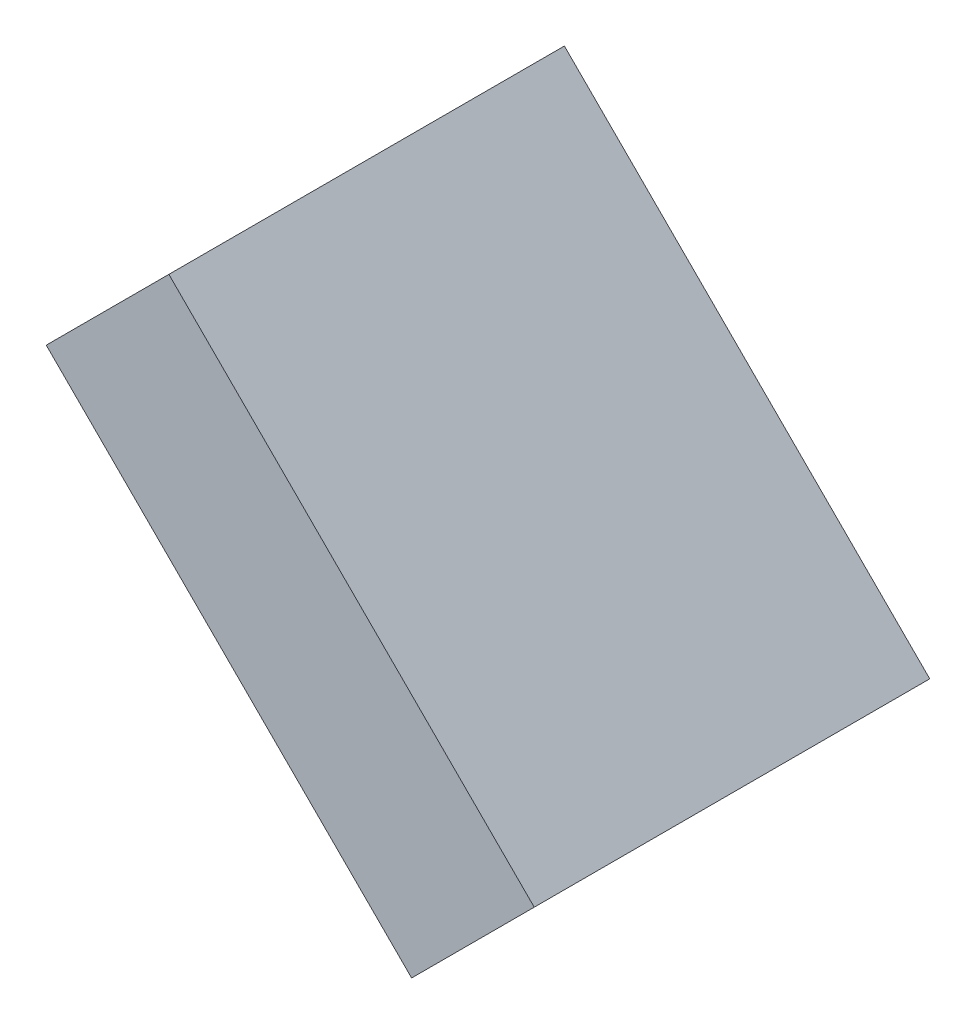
ISO-10303-21;
HEADER;
FILE_DESCRIPTION(('STEP AP214'),'2;1');
FILE_NAME('part.step','',(''),(''),'','','');
FILE_SCHEMA(('AUTOMOTIVE_DESIGN { 1 0 10303 214 1 1 1 1 }'));
ENDSEC;
DATA;
#1=APPLICATION_CONTEXT('core data for automotive mechanical design processes');
#2=APPLICATION_PROTOCOL_DEFINITION('international standard','automotive_design',2000,#1);
#3=PRODUCT_CONTEXT('',#1,'mechanical');
#4=PRODUCT('Part','Part','',(#3));
#5=PRODUCT_RELATED_PRODUCT_CATEGORY('part','',(#4));
#6=PRODUCT_DEFINITION_FORMATION('','',#4);
#7=PRODUCT_DEFINITION_CONTEXT('part definition',#1,'design');
#8=PRODUCT_DEFINITION('design','',#6,#7);
#9=PRODUCT_DEFINITION_SHAPE('','',#8);
#10=(LENGTH_UNIT() NAMED_UNIT(*) SI_UNIT(.MILLI.,.METRE.));
#11=(NAMED_UNIT(*) PLANE_ANGLE_UNIT() SI_UNIT($,.RADIAN.));
#12=(NAMED_UNIT(*) SI_UNIT($,.STERADIAN.) SOLID_ANGLE_UNIT());
#13=UNCERTAINTY_MEASURE_WITH_UNIT(LENGTH_MEASURE(1.E-05),#10,'distance_accuracy_value','');
#14=(GEOMETRIC_REPRESENTATION_CONTEXT(3) GLOBAL_UNCERTAINTY_ASSIGNED_CONTEXT((#13)) GLOBAL_UNIT_ASSIGNED_CONTEXT((#10,
#11,#12)) REPRESENTATION_CONTEXT('',''));
#15=CARTESIAN_POINT('',(0.,0.,0.));
#16=DIRECTION('',(0.,0.,1.));
#17=DIRECTION('',(1.,0.,0.));
#18=AXIS2_PLACEMENT_3D('',#15,#16,#17);
#19=CARTESIAN_POINT('',(1.270000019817E-06,0.,0.22999954));
#20=DIRECTION('',(0.,0.,-1.));
#21=DIRECTION('',(0.,-1.,0.));
#22=AXIS2_PLACEMENT_3D('',#19,#20,#21);
#23=PLANE('',#22);
#24=DIRECTION('',(-0.707111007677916,0.707102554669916,0.));
#25=VECTOR('',#24,1.);
#26=CARTESIAN_POINT('',(0.07058406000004,-0.14189202,0.22999954));
#27=LINE('',#26,#25);
#28=CARTESIAN_POINT('',(0.07058406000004,-0.14189202,0.22999954));
#29=VERTEX_POINT('',#28);
#30=CARTESIAN_POINT('',(-0.14189202,0.07058151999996,0.22999954));
#31=VERTEX_POINT('',#30);
#32=EDGE_CURVE('E27',#29,#31,#27,.T.);
#33=ORIENTED_EDGE('',*,*,#32,.F.);
#34=DIRECTION('',(-0.707106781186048,-0.707106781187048,0.));
#35=VECTOR('',#34,1.);
#36=CARTESIAN_POINT('',(0.14189456,-0.07058151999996,0.22999954));
#37=LINE('',#36,#35);
#38=CARTESIAN_POINT('',(0.14189456,-0.07058151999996,0.22999954));
#39=VERTEX_POINT('',#38);
#40=EDGE_CURVE('E65',#39,#29,#37,.T.);
#41=ORIENTED_EDGE('',*,*,#40,.F.);
#42=DIRECTION('',(0.707111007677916,-0.707102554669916,0.));
#43=VECTOR('',#42,1.);
#44=CARTESIAN_POINT('',(-0.07058151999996,0.14189202,0.22999954));
#45=LINE('',#44,#43);
#46=CARTESIAN_POINT('',(-0.07058151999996,0.14189202,0.22999954));
#47=VERTEX_POINT('',#46);
#48=EDGE_CURVE('E74',#47,#39,#45,.T.);
#49=ORIENTED_EDGE('',*,*,#48,.F.);
#50=DIRECTION('',(0.707106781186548,0.707106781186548,0.));
#51=VECTOR('',#50,1.);
#52=CARTESIAN_POINT('',(-0.14189202,0.07058151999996,0.22999954));
#53=LINE('',#52,#51);
#54=EDGE_CURVE('E85',#31,#47,#53,.T.);
#55=ORIENTED_EDGE('',*,*,#54,.F.);
#56=EDGE_LOOP('',(#33,#41,#49,#55));
#57=FACE_BOUND('',#56,.T.);
#58=ADVANCED_FACE('F17',(#57),#23,.F.);
#59=CARTESIAN_POINT('',(1.270000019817E-06,0.,0.));
#60=DIRECTION('',(0.,0.,-1.));
#61=DIRECTION('',(0.,-1.,0.));
#62=AXIS2_PLACEMENT_3D('',#59,#60,#61);
#63=PLANE('',#62);
#64=DIRECTION('',(0.707106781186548,0.707106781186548,0.));
#65=VECTOR('',#64,1.);
#66=CARTESIAN_POINT('',(-0.14189202,0.07058151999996,0.));
#67=LINE('',#66,#65);
#68=CARTESIAN_POINT('',(-0.14189202,0.07058151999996,0.));
#69=VERTEX_POINT('',#68);
#70=CARTESIAN_POINT('',(-0.07058151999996,0.14189202,0.));
#71=VERTEX_POINT('',#70);
#72=EDGE_CURVE('E94',#69,#71,#67,.T.);
#73=ORIENTED_EDGE('',*,*,#72,.T.);
#74=DIRECTION('',(0.707111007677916,-0.707102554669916,0.));
#75=VECTOR('',#74,1.);
#76=CARTESIAN_POINT('',(-0.07058151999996,0.14189202,0.));
#77=LINE('',#76,#75);
#78=CARTESIAN_POINT('',(0.14189456,-0.07058151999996,0.));
#79=VERTEX_POINT('',#78);
#80=EDGE_CURVE('E112',#71,#79,#77,.T.);
#81=ORIENTED_EDGE('',*,*,#80,.T.);
#82=DIRECTION('',(-0.707106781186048,-0.707106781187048,0.));
#83=VECTOR('',#82,1.);
#84=CARTESIAN_POINT('',(0.14189456,-0.07058151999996,0.));
#85=LINE('',#84,#83);
#86=CARTESIAN_POINT('',(0.07058406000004,-0.14189202,0.));
#87=VERTEX_POINT('',#86);
#88=EDGE_CURVE('E20',#79,#87,#85,.T.);
#89=ORIENTED_EDGE('',*,*,#88,.T.);
#90=DIRECTION('',(-0.707111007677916,0.707102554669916,0.));
#91=VECTOR('',#90,1.);
#92=CARTESIAN_POINT('',(0.07058406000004,-0.14189202,0.));
#93=LINE('',#92,#91);
#94=EDGE_CURVE('E11',#87,#69,#93,.T.);
#95=ORIENTED_EDGE('',*,*,#94,.T.);
#96=EDGE_LOOP('',(#73,#81,#89,#95));
#97=FACE_BOUND('',#96,.T.);
#98=ADVANCED_FACE('F122',(#97),#63,.T.);
#99=CARTESIAN_POINT('',(0.07058406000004,-0.14189202,0.));
#100=DIRECTION('',(-0.707102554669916,-0.707111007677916,0.));
#101=DIRECTION('',(-0.707111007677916,0.707102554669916,0.));
#102=AXIS2_PLACEMENT_3D('',#99,#100,#101);
#103=PLANE('',#102);
#104=DIRECTION('',(0.,0.,1.));
#105=VECTOR('',#104,1.);
#106=CARTESIAN_POINT('',(0.07058406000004,-0.14189202,0.));
#107=LINE('',#106,#105);
#108=EDGE_CURVE('E81',#87,#29,#107,.T.);
#109=ORIENTED_EDGE('',*,*,#108,.T.);
#110=ORIENTED_EDGE('',*,*,#32,.T.);
#111=DIRECTION('',(0.,0.,1.));
#112=VECTOR('',#111,1.);
#113=CARTESIAN_POINT('',(-0.14189202,0.07058151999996,0.));
#114=LINE('',#113,#112);
#115=EDGE_CURVE('E80',#69,#31,#114,.T.);
#116=ORIENTED_EDGE('',*,*,#115,.F.);
#117=ORIENTED_EDGE('',*,*,#94,.F.);
#118=EDGE_LOOP('',(#109,#110,#116,#117));
#119=FACE_BOUND('',#118,.T.);
#120=ADVANCED_FACE('F78',(#119),#103,.T.);
#121=CARTESIAN_POINT('',(0.14189456,-0.07058151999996,0.));
#122=DIRECTION('',(0.707106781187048,-0.707106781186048,0.));
#123=DIRECTION('',(0.,0.,-1.));
#124=AXIS2_PLACEMENT_3D('',#121,#122,#123);
#125=PLANE('',#124);
#126=DIRECTION('',(0.,0.,1.));
#127=VECTOR('',#126,1.);
#128=CARTESIAN_POINT('',(0.14189456,-0.07058151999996,0.));
#129=LINE('',#128,#127);
#130=EDGE_CURVE('E103',#79,#39,#129,.T.);
#131=ORIENTED_EDGE('',*,*,#130,.T.);
#132=ORIENTED_EDGE('',*,*,#40,.T.);
#133=ORIENTED_EDGE('',*,*,#108,.F.);
#134=ORIENTED_EDGE('',*,*,#88,.F.);
#135=EDGE_LOOP('',(#131,#132,#133,#134));
#136=FACE_BOUND('',#135,.T.);
#137=ADVANCED_FACE('F117',(#136),#125,.T.);
#138=CARTESIAN_POINT('',(-0.07058151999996,0.14189202,0.));
#139=DIRECTION('',(0.707102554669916,0.707111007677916,0.));
#140=DIRECTION('',(0.,0.,-1.));
#141=AXIS2_PLACEMENT_3D('',#138,#139,#140);
#142=PLANE('',#141);
#143=DIRECTION('',(0.,0.,1.));
#144=VECTOR('',#143,1.);
#145=CARTESIAN_POINT('',(-0.07058151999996,0.14189202,0.));
#146=LINE('',#145,#144);
#147=EDGE_CURVE('E89',#71,#47,#146,.T.);
#148=ORIENTED_EDGE('',*,*,#147,.T.);
#149=ORIENTED_EDGE('',*,*,#48,.T.);
#150=ORIENTED_EDGE('',*,*,#130,.F.);
#151=ORIENTED_EDGE('',*,*,#80,.F.);
#152=EDGE_LOOP('',(#148,#149,#150,#151));
#153=FACE_BOUND('',#152,.T.);
#154=ADVANCED_FACE('F120',(#153),#142,.T.);
#155=CARTESIAN_POINT('',(-0.14189202,0.07058151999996,0.));
#156=DIRECTION('',(-0.707106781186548,0.707106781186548,0.));
#157=DIRECTION('',(0.,0.,1.));
#158=AXIS2_PLACEMENT_3D('',#155,#156,#157);
#159=PLANE('',#158);
#160=ORIENTED_EDGE('',*,*,#115,.T.);
#161=ORIENTED_EDGE('',*,*,#54,.T.);
#162=ORIENTED_EDGE('',*,*,#147,.F.);
#163=ORIENTED_EDGE('',*,*,#72,.F.);
#164=EDGE_LOOP('',(#160,#161,#162,#163));
#165=FACE_BOUND('',#164,.T.);
#166=ADVANCED_FACE('F92',(#165),#159,.T.);
#167=CLOSED_SHELL('',(#58,#98,#120,#137,#154,#166));
#168=MANIFOLD_SOLID_BREP('B1',#167);
#169=ADVANCED_BREP_SHAPE_REPRESENTATION('',(#18,#168),#14);
#170=SHAPE_DEFINITION_REPRESENTATION(#9,#169);
ENDSEC;
END-ISO-10303-21;
